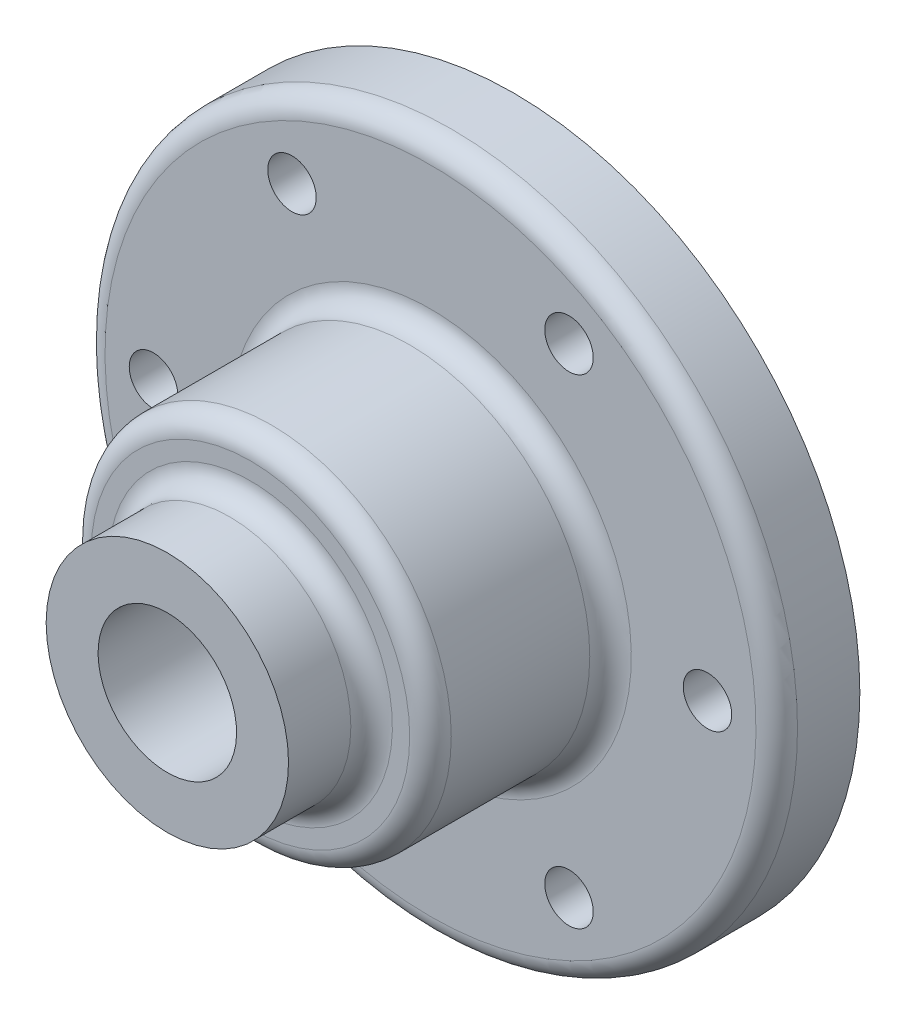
from build123d import *

# Parameters (mm, degrees)
F_7_0_7_DIAMETER_HOLE1_D = 7
CIRPATTERN1_COUNT        = 6
FILLET1_R                = 3


with BuildPart() as part:
    # Sketch1 → Revolve1 (revolve)
    with BuildSketch(Plane(origin=(0, 0, 0), x_dir=(0, 0, -1), z_dir=(1, 0, 0))):
        Polygon((-50, 17.5), (-50, 10), (-10, 10), (-10, 20), (0, 20), (0, 50), (-12, 50), (-12, 26), (-38, 26), (-38, 17.5), align=None)
    revolve(axis=Axis((0, 0, 0), (0, 0, 1)))

    # 7.0 _7_ Diameter Hole1 (through all)
    with Locations(Plane.XY.offset(12)):
        with Locations((40, 0)):
            f_7_0_7_diameter_hole1 = Hole(F_7_0_7_DIAMETER_HOLE1_D / 2)

    # CirPattern1: 7.0 _7_ Diameter Hole1 ×6 about axis
    cirpattern1_axis = Axis((0, 0, 0), (0, 0, 1))
    for i in range(1, CIRPATTERN1_COUNT):
        add(f_7_0_7_diameter_hole1.rotate(cirpattern1_axis, i * 360 / CIRPATTERN1_COUNT), mode=Mode.SUBTRACT)

    # Fillet1
    fillet1_edges = [part.edges().sort_by_distance(p)[0] for p in [
        (0, -17.5, 38),
        (0, -26, 38),
        (0, -26, 12),
        (0, -50, 12),
    ]]
    fillet(fillet1_edges, radius=FILLET1_R)

    # Groove Sketch → O-Ring Groove (revolve, cut)
    with BuildSketch(Plane.ZX, mode=Mode.PRIVATE) as o_ring_groove_sk:
        with BuildLine():
            Line((2.075, 27.25), (0, 27.25))
            Line((0, 27.25), (0, 30.8))
            Line((0, 30.8), (2.075, 30.8))
            ThreePointArc((2.075, 30.8), (2.499264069, 30.624264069), (2.675, 30.2))
            Line((2.675, 30.2), (2.675, 27.85))
            ThreePointArc((2.675, 27.85), (2.499264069, 27.425735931), (2.075, 27.25))
        make_face()
    revolve(o_ring_groove_sk.sketch.rotate(Axis((0, 0, -50), (0, 0, 1)), 270), axis=Axis((0, 0, -50), (0, 0, 1)), mode=Mode.SUBTRACT)


solid = part.part
